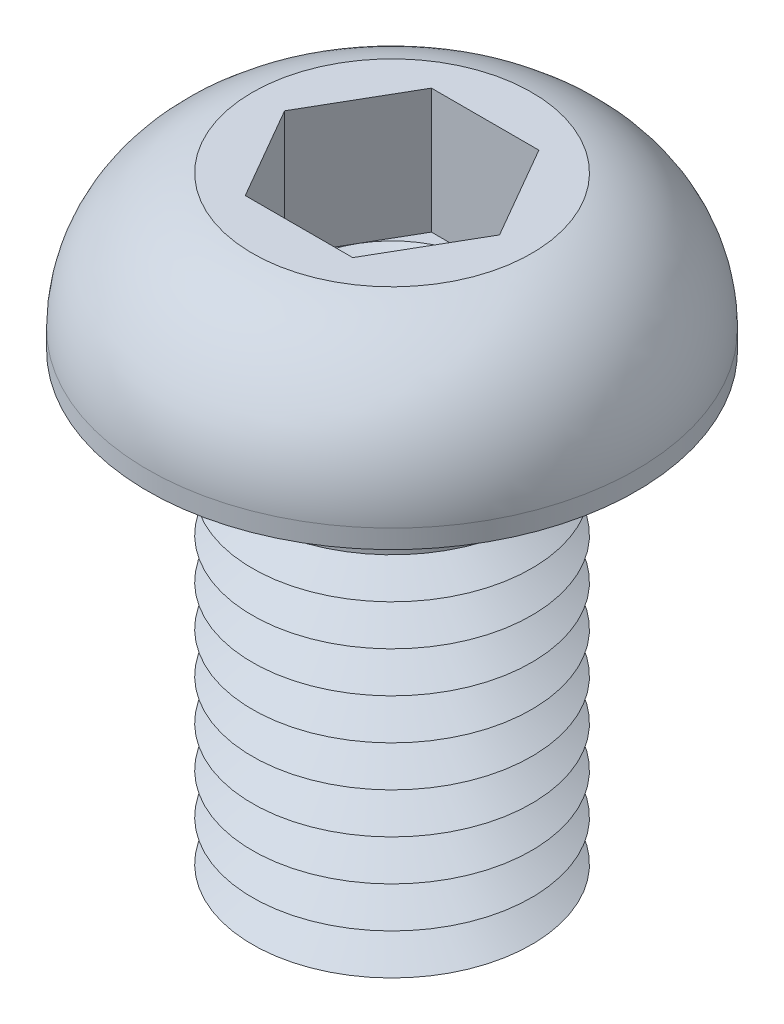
ISO-10303-21;
HEADER;
FILE_DESCRIPTION(('STEP AP214'),'2;1');
FILE_NAME('part.step','',(''),(''),'','','');
FILE_SCHEMA(('AUTOMOTIVE_DESIGN { 1 0 10303 214 1 1 1 1 }'));
ENDSEC;
DATA;
#1=APPLICATION_CONTEXT('core data for automotive mechanical design processes');
#2=APPLICATION_PROTOCOL_DEFINITION('international standard','automotive_design',2000,#1);
#3=PRODUCT_CONTEXT('',#1,'mechanical');
#4=PRODUCT('Part','Part','',(#3));
#5=PRODUCT_RELATED_PRODUCT_CATEGORY('part','',(#4));
#6=PRODUCT_DEFINITION_FORMATION('','',#4);
#7=PRODUCT_DEFINITION_CONTEXT('part definition',#1,'design');
#8=PRODUCT_DEFINITION('design','',#6,#7);
#9=PRODUCT_DEFINITION_SHAPE('','',#8);
#10=(LENGTH_UNIT() NAMED_UNIT(*) SI_UNIT(.MILLI.,.METRE.));
#11=(NAMED_UNIT(*) PLANE_ANGLE_UNIT() SI_UNIT($,.RADIAN.));
#12=(NAMED_UNIT(*) SI_UNIT($,.STERADIAN.) SOLID_ANGLE_UNIT());
#13=UNCERTAINTY_MEASURE_WITH_UNIT(LENGTH_MEASURE(1.E-05),#10,'distance_accuracy_value','');
#14=(GEOMETRIC_REPRESENTATION_CONTEXT(3) GLOBAL_UNCERTAINTY_ASSIGNED_CONTEXT((#13)) GLOBAL_UNIT_ASSIGNED_CONTEXT((#10,
#11,#12)) REPRESENTATION_CONTEXT('',''));
#15=CARTESIAN_POINT('',(0.,0.,0.));
#16=DIRECTION('',(0.,0.,1.));
#17=DIRECTION('',(1.,0.,0.));
#18=AXIS2_PLACEMENT_3D('',#15,#16,#17);
#19=CARTESIAN_POINT('',(0.,0.,0.));
#20=DIRECTION('',(0.,-1.,0.));
#21=DIRECTION('',(0.,0.,-1.));
#22=AXIS2_PLACEMENT_3D('',#19,#20,#21);
#23=TOROIDAL_SURFACE('',#22,6.875,0.875);
#24=CARTESIAN_POINT('',(0.,0.,-7.75));
#25=VERTEX_POINT('',#24);
#26=VERTEX_LOOP('',#25);
#27=FACE_BOUND('',#26,.T.);
#28=ADVANCED_FACE('P0_F12',(#27),#23,.T.);
#29=CLOSED_SHELL('',(#28));
#30=MANIFOLD_SOLID_BREP('P0_B1',#29);
#31=CARTESIAN_POINT('',(2.3094010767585,1.24,-4.));
#32=DIRECTION('',(0.,1.,0.));
#33=DIRECTION('',(0.,0.,1.));
#34=AXIS2_PLACEMENT_3D('',#31,#32,#33);
#35=PLANE('',#34);
#36=CARTESIAN_POINT('',(0.,1.24,0.));
#37=DIRECTION('',(0.,1.,0.));
#38=DIRECTION('',(0.,0.,1.));
#39=AXIS2_PLACEMENT_3D('',#36,#37,#38);
#40=CIRCLE('',#39,4.);
#41=CARTESIAN_POINT('',(0.,1.24,4.));
#42=VERTEX_POINT('',#41);
#43=CARTESIAN_POINT('',(3.46410161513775,1.24,2.));
#44=VERTEX_POINT('',#43);
#45=EDGE_CURVE('P1_E93',#42,#44,#40,.T.);
#46=ORIENTED_EDGE('',*,*,#45,.F.);
#47=DIRECTION('',(1.,0.,0.));
#48=VECTOR('',#47,1.);
#49=CARTESIAN_POINT('',(-2.3094010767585,1.24,4.));
#50=LINE('',#49,#48);
#51=CARTESIAN_POINT('',(2.3094010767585,1.24,4.));
#52=VERTEX_POINT('',#51);
#53=EDGE_CURVE('P1_E116',#42,#52,#50,.T.);
#54=ORIENTED_EDGE('',*,*,#53,.T.);
#55=DIRECTION('',(0.5,0.,-0.866025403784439));
#56=VECTOR('',#55,1.);
#57=CARTESIAN_POINT('',(2.3094010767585,1.24,4.));
#58=LINE('',#57,#56);
#59=EDGE_CURVE('P1_E112',#52,#44,#58,.T.);
#60=ORIENTED_EDGE('',*,*,#59,.T.);
#61=EDGE_LOOP('',(#46,#54,#60));
#62=FACE_BOUND('',#61,.T.);
#63=ADVANCED_FACE('P1_F15',(#62),#35,.T.);
#64=CARTESIAN_POINT('',(0.,1.24,0.));
#65=DIRECTION('',(0.,1.,0.));
#66=DIRECTION('',(0.,0.,1.));
#67=AXIS2_PLACEMENT_3D('',#64,#65,#66);
#68=CIRCLE('',#67,4.);
#69=CARTESIAN_POINT('',(3.46410161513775,1.24,-2.));
#70=VERTEX_POINT('',#69);
#71=EDGE_CURVE('P1_E10',#44,#70,#68,.T.);
#72=ORIENTED_EDGE('',*,*,#71,.F.);
#73=CARTESIAN_POINT('',(4.61880215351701,1.24,0.));
#74=VERTEX_POINT('',#73);
#75=EDGE_CURVE('P1_E104',#44,#74,#58,.T.);
#76=ORIENTED_EDGE('',*,*,#75,.T.);
#77=DIRECTION('',(-0.5,0.,-0.866025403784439));
#78=VECTOR('',#77,1.);
#79=CARTESIAN_POINT('',(4.61880215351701,1.24,0.));
#80=LINE('',#79,#78);
#81=EDGE_CURVE('P1_E107',#74,#70,#80,.T.);
#82=ORIENTED_EDGE('',*,*,#81,.T.);
#83=EDGE_LOOP('',(#72,#76,#82));
#84=FACE_BOUND('',#83,.T.);
#85=ADVANCED_FACE('P1_F103',(#84),#35,.T.);
#86=CARTESIAN_POINT('',(0.,1.24,-4.));
#87=VERTEX_POINT('',#86);
#88=EDGE_CURVE('P1_E24',#70,#87,#68,.T.);
#89=ORIENTED_EDGE('',*,*,#88,.F.);
#90=CARTESIAN_POINT('',(2.3094010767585,1.24,-4.));
#91=VERTEX_POINT('',#90);
#92=EDGE_CURVE('P1_E139',#70,#91,#80,.T.);
#93=ORIENTED_EDGE('',*,*,#92,.T.);
#94=DIRECTION('',(-1.,0.,0.));
#95=VECTOR('',#94,1.);
#96=CARTESIAN_POINT('',(2.3094010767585,1.24,-4.));
#97=LINE('',#96,#95);
#98=EDGE_CURVE('P1_E282',#91,#87,#97,.T.);
#99=ORIENTED_EDGE('',*,*,#98,.T.);
#100=EDGE_LOOP('',(#89,#93,#99));
#101=FACE_BOUND('',#100,.T.);
#102=ADVANCED_FACE('P1_F247',(#101),#35,.T.);
#103=CARTESIAN_POINT('',(-3.46410161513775,1.24,-2.));
#104=VERTEX_POINT('',#103);
#105=EDGE_CURVE('P1_E277',#87,#104,#68,.T.);
#106=ORIENTED_EDGE('',*,*,#105,.F.);
#107=CARTESIAN_POINT('',(-2.3094010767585,1.24,-4.));
#108=VERTEX_POINT('',#107);
#109=EDGE_CURVE('P1_E286',#87,#108,#97,.T.);
#110=ORIENTED_EDGE('',*,*,#109,.T.);
#111=DIRECTION('',(-0.5,0.,0.866025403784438));
#112=VECTOR('',#111,1.);
#113=CARTESIAN_POINT('',(-2.3094010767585,1.24,-4.));
#114=LINE('',#113,#112);
#115=EDGE_CURVE('P1_E281',#108,#104,#114,.T.);
#116=ORIENTED_EDGE('',*,*,#115,.T.);
#117=EDGE_LOOP('',(#106,#110,#116));
#118=FACE_BOUND('',#117,.T.);
#119=ADVANCED_FACE('P1_F261',(#118),#35,.T.);
#120=CARTESIAN_POINT('',(-3.46410161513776,1.24,2.));
#121=VERTEX_POINT('',#120);
#122=EDGE_CURVE('P1_E31',#104,#121,#68,.T.);
#123=ORIENTED_EDGE('',*,*,#122,.F.);
#124=CARTESIAN_POINT('',(-4.61880215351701,1.24,0.));
#125=VERTEX_POINT('',#124);
#126=EDGE_CURVE('P1_E273',#104,#125,#114,.T.);
#127=ORIENTED_EDGE('',*,*,#126,.T.);
#128=DIRECTION('',(0.5,0.,0.866025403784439));
#129=VECTOR('',#128,1.);
#130=CARTESIAN_POINT('',(-4.61880215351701,1.24,0.));
#131=LINE('',#130,#129);
#132=EDGE_CURVE('P1_E276',#125,#121,#131,.T.);
#133=ORIENTED_EDGE('',*,*,#132,.T.);
#134=EDGE_LOOP('',(#123,#127,#133));
#135=FACE_BOUND('',#134,.T.);
#136=ADVANCED_FACE('P1_F252',(#135),#35,.T.);
#137=CARTESIAN_POINT('',(0.,-18.25,0.));
#138=DIRECTION('',(0.,1.,0.));
#139=DIRECTION('',(0.,0.,1.));
#140=AXIS2_PLACEMENT_3D('',#137,#138,#139);
#141=CONICAL_SURFACE('',#140,4.48445554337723,1.0471975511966);
#142=CARTESIAN_POINT('',(0.,-17.375,0.));
#143=DIRECTION('',(0.,-1.,0.));
#144=DIRECTION('',(0.,0.,-1.));
#145=AXIS2_PLACEMENT_3D('',#142,#143,#144);
#146=CIRCLE('',#145,6.);
#147=CARTESIAN_POINT('',(0.,-17.375,-6.));
#148=VERTEX_POINT('',#147);
#149=EDGE_CURVE('P1_E209',#148,#148,#146,.T.);
#150=ORIENTED_EDGE('',*,*,#149,.T.);
#151=EDGE_LOOP('',(#150));
#152=FACE_BOUND('',#151,.T.);
#153=CARTESIAN_POINT('',(0.,-18.25,0.));
#154=DIRECTION('',(0.,-1.,0.));
#155=DIRECTION('',(0.,0.,-1.));
#156=AXIS2_PLACEMENT_3D('',#153,#154,#155);
#157=CIRCLE('',#156,4.48445554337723);
#158=CARTESIAN_POINT('',(0.,-18.25,-4.48445554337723));
#159=VERTEX_POINT('',#158);
#160=EDGE_CURVE('P1_E212',#159,#159,#157,.T.);
#161=ORIENTED_EDGE('',*,*,#160,.F.);
#162=EDGE_LOOP('',(#161));
#163=FACE_BOUND('',#162,.T.);
#164=ADVANCED_FACE('P1_F260',(#152,#163),#141,.T.);
#165=CARTESIAN_POINT('',(0.,-19.125,0.));
#166=DIRECTION('',(0.,-1.,0.));
#167=DIRECTION('',(0.,0.,-1.));
#168=AXIS2_PLACEMENT_3D('',#165,#166,#167);
#169=CONICAL_SURFACE('',#168,6.,1.0471975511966);
#170=ORIENTED_EDGE('',*,*,#160,.T.);
#171=EDGE_LOOP('',(#170));
#172=FACE_BOUND('',#171,.T.);
#173=CARTESIAN_POINT('',(0.,-19.125,0.));
#174=DIRECTION('',(0.,-1.,0.));
#175=DIRECTION('',(0.,0.,-1.));
#176=AXIS2_PLACEMENT_3D('',#173,#174,#175);
#177=CIRCLE('',#176,6.);
#178=CARTESIAN_POINT('',(0.,-19.125,-6.));
#179=VERTEX_POINT('',#178);
#180=EDGE_CURVE('P1_E215',#179,#179,#177,.T.);
#181=ORIENTED_EDGE('',*,*,#180,.F.);
#182=EDGE_LOOP('',(#181));
#183=FACE_BOUND('',#182,.T.);
#184=ADVANCED_FACE('P1_F267',(#172,#183),#169,.T.);
#185=CARTESIAN_POINT('',(0.,-20.,0.));
#186=DIRECTION('',(0.,1.,0.));
#187=DIRECTION('',(0.,0.,1.));
#188=AXIS2_PLACEMENT_3D('',#185,#186,#187);
#189=PLANE('',#188);
#190=CARTESIAN_POINT('',(0.,-20.,0.));
#191=DIRECTION('',(0.,-1.,0.));
#192=DIRECTION('',(0.,0.,-1.));
#193=AXIS2_PLACEMENT_3D('',#190,#191,#192);
#194=CIRCLE('',#193,4.48445554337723);
#195=CARTESIAN_POINT('',(0.,-20.,-4.48445554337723));
#196=VERTEX_POINT('',#195);
#197=EDGE_CURVE('P1_E218',#196,#196,#194,.T.);
#198=ORIENTED_EDGE('',*,*,#197,.T.);
#199=EDGE_LOOP('',(#198));
#200=FACE_BOUND('',#199,.T.);
#201=ADVANCED_FACE('P1_F345',(#200),#189,.F.);
#202=CARTESIAN_POINT('',(0.,-20.,0.));
#203=DIRECTION('',(0.,1.,0.));
#204=DIRECTION('',(0.,0.,1.));
#205=AXIS2_PLACEMENT_3D('',#202,#203,#204);
#206=CONICAL_SURFACE('',#205,4.48445554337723,1.0471975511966);
#207=ORIENTED_EDGE('',*,*,#180,.T.);
#208=EDGE_LOOP('',(#207));
#209=FACE_BOUND('',#208,.T.);
#210=ORIENTED_EDGE('',*,*,#197,.F.);
#211=EDGE_LOOP('',(#210));
#212=FACE_BOUND('',#211,.T.);
#213=ADVANCED_FACE('P1_F356',(#209,#212),#206,.T.);
#214=CARTESIAN_POINT('',(0.,-16.5,0.));
#215=DIRECTION('',(0.,1.,0.));
#216=DIRECTION('',(0.,0.,1.));
#217=AXIS2_PLACEMENT_3D('',#214,#215,#216);
#218=CONICAL_SURFACE('',#217,4.48445554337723,1.0471975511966);
#219=CARTESIAN_POINT('',(0.,-15.625,0.));
#220=DIRECTION('',(0.,-1.,0.));
#221=DIRECTION('',(0.,0.,-1.));
#222=AXIS2_PLACEMENT_3D('',#219,#220,#221);
#223=CIRCLE('',#222,6.);
#224=CARTESIAN_POINT('',(0.,-15.625,-6.));
#225=VERTEX_POINT('',#224);
#226=EDGE_CURVE('P1_E203',#225,#225,#223,.T.);
#227=ORIENTED_EDGE('',*,*,#226,.T.);
#228=EDGE_LOOP('',(#227));
#229=FACE_BOUND('',#228,.T.);
#230=CARTESIAN_POINT('',(0.,-16.5,0.));
#231=DIRECTION('',(0.,-1.,0.));
#232=DIRECTION('',(0.,0.,-1.));
#233=AXIS2_PLACEMENT_3D('',#230,#231,#232);
#234=CIRCLE('',#233,4.48445554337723);
#235=CARTESIAN_POINT('',(0.,-16.5,-4.48445554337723));
#236=VERTEX_POINT('',#235);
#237=EDGE_CURVE('P1_E206',#236,#236,#234,.T.);
#238=ORIENTED_EDGE('',*,*,#237,.F.);
#239=EDGE_LOOP('',(#238));
#240=FACE_BOUND('',#239,.T.);
#241=ADVANCED_FACE('P1_F365',(#229,#240),#218,.T.);
#242=CARTESIAN_POINT('',(0.,-17.375,0.));
#243=DIRECTION('',(0.,-1.,0.));
#244=DIRECTION('',(0.,0.,-1.));
#245=AXIS2_PLACEMENT_3D('',#242,#243,#244);
#246=CONICAL_SURFACE('',#245,6.,1.0471975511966);
#247=ORIENTED_EDGE('',*,*,#237,.T.);
#248=EDGE_LOOP('',(#247));
#249=FACE_BOUND('',#248,.T.);
#250=ORIENTED_EDGE('',*,*,#149,.F.);
#251=EDGE_LOOP('',(#250));
#252=FACE_BOUND('',#251,.T.);
#253=ADVANCED_FACE('P1_F374',(#249,#252),#246,.T.);
#254=CARTESIAN_POINT('',(0.,-14.75,0.));
#255=DIRECTION('',(0.,1.,0.));
#256=DIRECTION('',(0.,0.,1.));
#257=AXIS2_PLACEMENT_3D('',#254,#255,#256);
#258=CONICAL_SURFACE('',#257,4.48445554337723,1.0471975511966);
#259=CARTESIAN_POINT('',(0.,-13.875,0.));
#260=DIRECTION('',(0.,-1.,0.));
#261=DIRECTION('',(0.,0.,-1.));
#262=AXIS2_PLACEMENT_3D('',#259,#260,#261);
#263=CIRCLE('',#262,6.);
#264=CARTESIAN_POINT('',(0.,-13.875,-6.));
#265=VERTEX_POINT('',#264);
#266=EDGE_CURVE('P1_E197',#265,#265,#263,.T.);
#267=ORIENTED_EDGE('',*,*,#266,.T.);
#268=EDGE_LOOP('',(#267));
#269=FACE_BOUND('',#268,.T.);
#270=CARTESIAN_POINT('',(0.,-14.75,0.));
#271=DIRECTION('',(0.,-1.,0.));
#272=DIRECTION('',(0.,0.,-1.));
#273=AXIS2_PLACEMENT_3D('',#270,#271,#272);
#274=CIRCLE('',#273,4.48445554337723);
#275=CARTESIAN_POINT('',(0.,-14.75,-4.48445554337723));
#276=VERTEX_POINT('',#275);
#277=EDGE_CURVE('P1_E200',#276,#276,#274,.T.);
#278=ORIENTED_EDGE('',*,*,#277,.F.);
#279=EDGE_LOOP('',(#278));
#280=FACE_BOUND('',#279,.T.);
#281=ADVANCED_FACE('P1_F384',(#269,#280),#258,.T.);
#282=CARTESIAN_POINT('',(0.,-15.625,0.));
#283=DIRECTION('',(0.,-1.,0.));
#284=DIRECTION('',(0.,0.,-1.));
#285=AXIS2_PLACEMENT_3D('',#282,#283,#284);
#286=CONICAL_SURFACE('',#285,6.,1.0471975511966);
#287=ORIENTED_EDGE('',*,*,#277,.T.);
#288=EDGE_LOOP('',(#287));
#289=FACE_BOUND('',#288,.T.);
#290=ORIENTED_EDGE('',*,*,#226,.F.);
#291=EDGE_LOOP('',(#290));
#292=FACE_BOUND('',#291,.T.);
#293=ADVANCED_FACE('P1_F394',(#289,#292),#286,.T.);
#294=CARTESIAN_POINT('',(0.,-13.,0.));
#295=DIRECTION('',(0.,1.,0.));
#296=DIRECTION('',(0.,0.,1.));
#297=AXIS2_PLACEMENT_3D('',#294,#295,#296);
#298=CONICAL_SURFACE('',#297,4.48445554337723,1.0471975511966);
#299=CARTESIAN_POINT('',(0.,-12.125,0.));
#300=DIRECTION('',(0.,-1.,0.));
#301=DIRECTION('',(0.,0.,-1.));
#302=AXIS2_PLACEMENT_3D('',#299,#300,#301);
#303=CIRCLE('',#302,6.);
#304=CARTESIAN_POINT('',(0.,-12.125,-6.));
#305=VERTEX_POINT('',#304);
#306=EDGE_CURVE('P1_E191',#305,#305,#303,.T.);
#307=ORIENTED_EDGE('',*,*,#306,.T.);
#308=EDGE_LOOP('',(#307));
#309=FACE_BOUND('',#308,.T.);
#310=CARTESIAN_POINT('',(0.,-13.,0.));
#311=DIRECTION('',(0.,-1.,0.));
#312=DIRECTION('',(0.,0.,-1.));
#313=AXIS2_PLACEMENT_3D('',#310,#311,#312);
#314=CIRCLE('',#313,4.48445554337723);
#315=CARTESIAN_POINT('',(0.,-13.,-4.48445554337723));
#316=VERTEX_POINT('',#315);
#317=EDGE_CURVE('P1_E194',#316,#316,#314,.T.);
#318=ORIENTED_EDGE('',*,*,#317,.F.);
#319=EDGE_LOOP('',(#318));
#320=FACE_BOUND('',#319,.T.);
#321=ADVANCED_FACE('P1_F404',(#309,#320),#298,.T.);
#322=CARTESIAN_POINT('',(0.,-13.875,0.));
#323=DIRECTION('',(0.,-1.,0.));
#324=DIRECTION('',(0.,0.,-1.));
#325=AXIS2_PLACEMENT_3D('',#322,#323,#324);
#326=CONICAL_SURFACE('',#325,6.,1.0471975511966);
#327=ORIENTED_EDGE('',*,*,#317,.T.);
#328=EDGE_LOOP('',(#327));
#329=FACE_BOUND('',#328,.T.);
#330=ORIENTED_EDGE('',*,*,#266,.F.);
#331=EDGE_LOOP('',(#330));
#332=FACE_BOUND('',#331,.T.);
#333=ADVANCED_FACE('P1_F414',(#329,#332),#326,.T.);
#334=CARTESIAN_POINT('',(0.,-11.25,0.));
#335=DIRECTION('',(0.,1.,0.));
#336=DIRECTION('',(0.,0.,1.));
#337=AXIS2_PLACEMENT_3D('',#334,#335,#336);
#338=CONICAL_SURFACE('',#337,4.48445554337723,1.0471975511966);
#339=CARTESIAN_POINT('',(0.,-10.375,0.));
#340=DIRECTION('',(0.,-1.,0.));
#341=DIRECTION('',(0.,0.,-1.));
#342=AXIS2_PLACEMENT_3D('',#339,#340,#341);
#343=CIRCLE('',#342,6.);
#344=CARTESIAN_POINT('',(0.,-10.375,-6.));
#345=VERTEX_POINT('',#344);
#346=EDGE_CURVE('P1_E185',#345,#345,#343,.T.);
#347=ORIENTED_EDGE('',*,*,#346,.T.);
#348=EDGE_LOOP('',(#347));
#349=FACE_BOUND('',#348,.T.);
#350=CARTESIAN_POINT('',(0.,-11.25,0.));
#351=DIRECTION('',(0.,-1.,0.));
#352=DIRECTION('',(0.,0.,-1.));
#353=AXIS2_PLACEMENT_3D('',#350,#351,#352);
#354=CIRCLE('',#353,4.48445554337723);
#355=CARTESIAN_POINT('',(0.,-11.25,-4.48445554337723));
#356=VERTEX_POINT('',#355);
#357=EDGE_CURVE('P1_E188',#356,#356,#354,.T.);
#358=ORIENTED_EDGE('',*,*,#357,.F.);
#359=EDGE_LOOP('',(#358));
#360=FACE_BOUND('',#359,.T.);
#361=ADVANCED_FACE('P1_F424',(#349,#360),#338,.T.);
#362=CARTESIAN_POINT('',(0.,-12.125,0.));
#363=DIRECTION('',(0.,-1.,0.));
#364=DIRECTION('',(0.,0.,-1.));
#365=AXIS2_PLACEMENT_3D('',#362,#363,#364);
#366=CONICAL_SURFACE('',#365,6.,1.0471975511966);
#367=ORIENTED_EDGE('',*,*,#357,.T.);
#368=EDGE_LOOP('',(#367));
#369=FACE_BOUND('',#368,.T.);
#370=ORIENTED_EDGE('',*,*,#306,.F.);
#371=EDGE_LOOP('',(#370));
#372=FACE_BOUND('',#371,.T.);
#373=ADVANCED_FACE('P1_F434',(#369,#372),#366,.T.);
#374=CARTESIAN_POINT('',(0.,-9.5,0.));
#375=DIRECTION('',(0.,1.,0.));
#376=DIRECTION('',(0.,0.,1.));
#377=AXIS2_PLACEMENT_3D('',#374,#375,#376);
#378=CONICAL_SURFACE('',#377,4.48445554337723,1.0471975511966);
#379=CARTESIAN_POINT('',(0.,-8.625,0.));
#380=DIRECTION('',(0.,-1.,0.));
#381=DIRECTION('',(0.,0.,-1.));
#382=AXIS2_PLACEMENT_3D('',#379,#380,#381);
#383=CIRCLE('',#382,6.);
#384=CARTESIAN_POINT('',(0.,-8.625,-6.));
#385=VERTEX_POINT('',#384);
#386=EDGE_CURVE('P1_E179',#385,#385,#383,.T.);
#387=ORIENTED_EDGE('',*,*,#386,.T.);
#388=EDGE_LOOP('',(#387));
#389=FACE_BOUND('',#388,.T.);
#390=CARTESIAN_POINT('',(0.,-9.5,0.));
#391=DIRECTION('',(0.,-1.,0.));
#392=DIRECTION('',(0.,0.,-1.));
#393=AXIS2_PLACEMENT_3D('',#390,#391,#392);
#394=CIRCLE('',#393,4.48445554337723);
#395=CARTESIAN_POINT('',(0.,-9.5,-4.48445554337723));
#396=VERTEX_POINT('',#395);
#397=EDGE_CURVE('P1_E182',#396,#396,#394,.T.);
#398=ORIENTED_EDGE('',*,*,#397,.F.);
#399=EDGE_LOOP('',(#398));
#400=FACE_BOUND('',#399,.T.);
#401=ADVANCED_FACE('P1_F444',(#389,#400),#378,.T.);
#402=CARTESIAN_POINT('',(0.,-10.375,0.));
#403=DIRECTION('',(0.,-1.,0.));
#404=DIRECTION('',(0.,0.,-1.));
#405=AXIS2_PLACEMENT_3D('',#402,#403,#404);
#406=CONICAL_SURFACE('',#405,6.,1.0471975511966);
#407=ORIENTED_EDGE('',*,*,#397,.T.);
#408=EDGE_LOOP('',(#407));
#409=FACE_BOUND('',#408,.T.);
#410=ORIENTED_EDGE('',*,*,#346,.F.);
#411=EDGE_LOOP('',(#410));
#412=FACE_BOUND('',#411,.T.);
#413=ADVANCED_FACE('P1_F454',(#409,#412),#406,.T.);
#414=CARTESIAN_POINT('',(0.,-7.75,0.));
#415=DIRECTION('',(0.,1.,0.));
#416=DIRECTION('',(0.,0.,1.));
#417=AXIS2_PLACEMENT_3D('',#414,#415,#416);
#418=CONICAL_SURFACE('',#417,4.48445554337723,1.0471975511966);
#419=CARTESIAN_POINT('',(0.,-6.875,0.));
#420=DIRECTION('',(0.,-1.,0.));
#421=DIRECTION('',(0.,0.,-1.));
#422=AXIS2_PLACEMENT_3D('',#419,#420,#421);
#423=CIRCLE('',#422,6.);
#424=CARTESIAN_POINT('',(0.,-6.875,-6.));
#425=VERTEX_POINT('',#424);
#426=EDGE_CURVE('P1_E173',#425,#425,#423,.T.);
#427=ORIENTED_EDGE('',*,*,#426,.T.);
#428=EDGE_LOOP('',(#427));
#429=FACE_BOUND('',#428,.T.);
#430=CARTESIAN_POINT('',(0.,-7.75,0.));
#431=DIRECTION('',(0.,-1.,0.));
#432=DIRECTION('',(0.,0.,-1.));
#433=AXIS2_PLACEMENT_3D('',#430,#431,#432);
#434=CIRCLE('',#433,4.48445554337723);
#435=CARTESIAN_POINT('',(0.,-7.75,-4.48445554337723));
#436=VERTEX_POINT('',#435);
#437=EDGE_CURVE('P1_E176',#436,#436,#434,.T.);
#438=ORIENTED_EDGE('',*,*,#437,.F.);
#439=EDGE_LOOP('',(#438));
#440=FACE_BOUND('',#439,.T.);
#441=ADVANCED_FACE('P1_F464',(#429,#440),#418,.T.);
#442=CARTESIAN_POINT('',(0.,-8.625,0.));
#443=DIRECTION('',(0.,-1.,0.));
#444=DIRECTION('',(0.,0.,-1.));
#445=AXIS2_PLACEMENT_3D('',#442,#443,#444);
#446=CONICAL_SURFACE('',#445,6.,1.0471975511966);
#447=ORIENTED_EDGE('',*,*,#437,.T.);
#448=EDGE_LOOP('',(#447));
#449=FACE_BOUND('',#448,.T.);
#450=ORIENTED_EDGE('',*,*,#386,.F.);
#451=EDGE_LOOP('',(#450));
#452=FACE_BOUND('',#451,.T.);
#453=ADVANCED_FACE('P1_F474',(#449,#452),#446,.T.);
#454=CARTESIAN_POINT('',(0.,-6.,0.));
#455=DIRECTION('',(0.,1.,0.));
#456=DIRECTION('',(0.,0.,1.));
#457=AXIS2_PLACEMENT_3D('',#454,#455,#456);
#458=CONICAL_SURFACE('',#457,4.48445554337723,1.0471975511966);
#459=CARTESIAN_POINT('',(0.,-5.125,0.));
#460=DIRECTION('',(0.,-1.,0.));
#461=DIRECTION('',(0.,0.,-1.));
#462=AXIS2_PLACEMENT_3D('',#459,#460,#461);
#463=CIRCLE('',#462,6.);
#464=CARTESIAN_POINT('',(0.,-5.125,-6.));
#465=VERTEX_POINT('',#464);
#466=EDGE_CURVE('P1_E164',#465,#465,#463,.T.);
#467=ORIENTED_EDGE('',*,*,#466,.T.);
#468=EDGE_LOOP('',(#467));
#469=FACE_BOUND('',#468,.T.);
#470=CARTESIAN_POINT('',(0.,-6.,0.));
#471=DIRECTION('',(0.,-1.,0.));
#472=DIRECTION('',(0.,0.,-1.));
#473=AXIS2_PLACEMENT_3D('',#470,#471,#472);
#474=CIRCLE('',#473,4.48445554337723);
#475=CARTESIAN_POINT('',(0.,-6.,-4.48445554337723));
#476=VERTEX_POINT('',#475);
#477=EDGE_CURVE('P1_E170',#476,#476,#474,.T.);
#478=ORIENTED_EDGE('',*,*,#477,.F.);
#479=EDGE_LOOP('',(#478));
#480=FACE_BOUND('',#479,.T.);
#481=ADVANCED_FACE('P1_F484',(#469,#480),#458,.T.);
#482=CARTESIAN_POINT('',(0.,-6.875,0.));
#483=DIRECTION('',(0.,-1.,0.));
#484=DIRECTION('',(0.,0.,-1.));
#485=AXIS2_PLACEMENT_3D('',#482,#483,#484);
#486=CONICAL_SURFACE('',#485,6.,1.0471975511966);
#487=ORIENTED_EDGE('',*,*,#477,.T.);
#488=EDGE_LOOP('',(#487));
#489=FACE_BOUND('',#488,.T.);
#490=ORIENTED_EDGE('',*,*,#426,.F.);
#491=EDGE_LOOP('',(#490));
#492=FACE_BOUND('',#491,.T.);
#493=ADVANCED_FACE('P1_F494',(#489,#492),#486,.T.);
#494=CARTESIAN_POINT('',(0.,-4.25,0.));
#495=DIRECTION('',(0.,1.,0.));
#496=DIRECTION('',(0.,0.,1.));
#497=AXIS2_PLACEMENT_3D('',#494,#495,#496);
#498=CONICAL_SURFACE('',#497,4.48445554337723,1.0471975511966);
#499=CARTESIAN_POINT('',(0.,-3.375,0.));
#500=DIRECTION('',(0.,-1.,0.));
#501=DIRECTION('',(0.,0.,-1.));
#502=AXIS2_PLACEMENT_3D('',#499,#500,#501);
#503=CIRCLE('',#502,6.);
#504=CARTESIAN_POINT('',(0.,-3.375,-6.));
#505=VERTEX_POINT('',#504);
#506=EDGE_CURVE('P1_E167',#505,#505,#503,.T.);
#507=ORIENTED_EDGE('',*,*,#506,.T.);
#508=EDGE_LOOP('',(#507));
#509=FACE_BOUND('',#508,.T.);
#510=CARTESIAN_POINT('',(0.,-4.25,0.));
#511=DIRECTION('',(0.,-1.,0.));
#512=DIRECTION('',(0.,0.,-1.));
#513=AXIS2_PLACEMENT_3D('',#510,#511,#512);
#514=CIRCLE('',#513,4.48445554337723);
#515=CARTESIAN_POINT('',(0.,-4.25,-4.48445554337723));
#516=VERTEX_POINT('',#515);
#517=EDGE_CURVE('P1_E161',#516,#516,#514,.T.);
#518=ORIENTED_EDGE('',*,*,#517,.F.);
#519=EDGE_LOOP('',(#518));
#520=FACE_BOUND('',#519,.T.);
#521=ADVANCED_FACE('P1_F504',(#509,#520),#498,.T.);
#522=CARTESIAN_POINT('',(0.,-5.125,0.));
#523=DIRECTION('',(0.,-1.,0.));
#524=DIRECTION('',(0.,0.,-1.));
#525=AXIS2_PLACEMENT_3D('',#522,#523,#524);
#526=CONICAL_SURFACE('',#525,6.,1.0471975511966);
#527=ORIENTED_EDGE('',*,*,#517,.T.);
#528=EDGE_LOOP('',(#527));
#529=FACE_BOUND('',#528,.T.);
#530=ORIENTED_EDGE('',*,*,#466,.F.);
#531=EDGE_LOOP('',(#530));
#532=FACE_BOUND('',#531,.T.);
#533=ADVANCED_FACE('P1_F514',(#529,#532),#526,.T.);
#534=CARTESIAN_POINT('',(0.,-20.,0.));
#535=DIRECTION('',(0.,1.,0.));
#536=DIRECTION('',(0.,0.,1.));
#537=AXIS2_PLACEMENT_3D('',#534,#535,#536);
#538=CYLINDRICAL_SURFACE('',#537,6.);
#539=CARTESIAN_POINT('',(0.,0.,0.));
#540=DIRECTION('',(0.,-1.,0.));
#541=DIRECTION('',(1.,0.,0.));
#542=AXIS2_PLACEMENT_3D('',#539,#540,#541);
#543=CIRCLE('',#542,6.);
#544=CARTESIAN_POINT('',(6.,0.,0.));
#545=VERTEX_POINT('',#544);
#546=EDGE_CURVE('P1_E141',#545,#545,#543,.F.);
#547=ORIENTED_EDGE('',*,*,#546,.F.);
#548=EDGE_LOOP('',(#547));
#549=FACE_BOUND('',#548,.T.);
#550=ORIENTED_EDGE('',*,*,#506,.F.);
#551=EDGE_LOOP('',(#550));
#552=FACE_BOUND('',#551,.T.);
#553=ADVANCED_FACE('P1_F17',(#549,#552),#538,.T.);
#554=CARTESIAN_POINT('',(0.,0.,0.));
#555=DIRECTION('',(0.,-1.,0.));
#556=DIRECTION('',(0.,0.,-1.));
#557=AXIS2_PLACEMENT_3D('',#554,#555,#556);
#558=TOROIDAL_SURFACE('',#557,6.875,0.875);
#559=ORIENTED_EDGE('',*,*,#546,.T.);
#560=EDGE_LOOP('',(#559));
#561=FACE_BOUND('',#560,.T.);
#562=CARTESIAN_POINT('',(0.,0.,0.));
#563=DIRECTION('',(0.,1.,0.));
#564=DIRECTION('',(-1.,0.,0.));
#565=AXIS2_PLACEMENT_3D('',#562,#563,#564);
#566=CIRCLE('',#565,7.75);
#567=CARTESIAN_POINT('',(-7.75,0.,0.));
#568=VERTEX_POINT('',#567);
#569=EDGE_CURVE('P1_E151',#568,#568,#566,.F.);
#570=ORIENTED_EDGE('',*,*,#569,.T.);
#571=EDGE_LOOP('',(#570));
#572=FACE_BOUND('',#571,.T.);
#573=ADVANCED_FACE('P1_F223',(#561,#572),#558,.F.);
#574=CARTESIAN_POINT('',(6.,6.6,0.));
#575=DIRECTION('',(0.,-1.,0.));
#576=DIRECTION('',(1.,0.,0.));
#577=AXIS2_PLACEMENT_3D('',#574,#575,#576);
#578=PLANE('',#577);
#579=DIRECTION('',(-1.,0.,0.));
#580=VECTOR('',#579,1.);
#581=CARTESIAN_POINT('',(2.3094010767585,6.6,-4.));
#582=LINE('',#581,#580);
#583=CARTESIAN_POINT('',(2.3094010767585,6.6,-4.));
#584=VERTEX_POINT('',#583);
#585=CARTESIAN_POINT('',(-2.3094010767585,6.6,-4.));
#586=VERTEX_POINT('',#585);
#587=EDGE_CURVE('P1_E125',#584,#586,#582,.T.);
#588=ORIENTED_EDGE('',*,*,#587,.F.);
#589=DIRECTION('',(-0.5,0.,-0.866025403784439));
#590=VECTOR('',#589,1.);
#591=CARTESIAN_POINT('',(4.61880215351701,6.6,0.));
#592=LINE('',#591,#590);
#593=CARTESIAN_POINT('',(4.61880215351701,6.6,0.));
#594=VERTEX_POINT('',#593);
#595=EDGE_CURVE('P1_E39',#594,#584,#592,.T.);
#596=ORIENTED_EDGE('',*,*,#595,.F.);
#597=DIRECTION('',(0.5,0.,-0.866025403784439));
#598=VECTOR('',#597,1.);
#599=CARTESIAN_POINT('',(2.3094010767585,6.6,4.));
#600=LINE('',#599,#598);
#601=CARTESIAN_POINT('',(2.3094010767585,6.6,4.));
#602=VERTEX_POINT('',#601);
#603=EDGE_CURVE('P1_E137',#602,#594,#600,.T.);
#604=ORIENTED_EDGE('',*,*,#603,.F.);
#605=DIRECTION('',(1.,0.,0.));
#606=VECTOR('',#605,1.);
#607=CARTESIAN_POINT('',(-2.3094010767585,6.6,4.));
#608=LINE('',#607,#606);
#609=CARTESIAN_POINT('',(-2.3094010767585,6.6,4.));
#610=VERTEX_POINT('',#609);
#611=EDGE_CURVE('P1_E134',#610,#602,#608,.T.);
#612=ORIENTED_EDGE('',*,*,#611,.F.);
#613=DIRECTION('',(0.5,0.,0.866025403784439));
#614=VECTOR('',#613,1.);
#615=CARTESIAN_POINT('',(-4.61880215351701,6.6,0.));
#616=LINE('',#615,#614);
#617=CARTESIAN_POINT('',(-4.61880215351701,6.6,0.));
#618=VERTEX_POINT('',#617);
#619=EDGE_CURVE('P1_E131',#618,#610,#616,.T.);
#620=ORIENTED_EDGE('',*,*,#619,.F.);
#621=DIRECTION('',(-0.5,0.,0.866025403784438));
#622=VECTOR('',#621,1.);
#623=CARTESIAN_POINT('',(-2.3094010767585,6.6,-4.));
#624=LINE('',#623,#622);
#625=EDGE_CURVE('P1_E128',#586,#618,#624,.T.);
#626=ORIENTED_EDGE('',*,*,#625,.F.);
#627=EDGE_LOOP('',(#588,#596,#604,#612,#620,#626));
#628=FACE_BOUND('',#627,.T.);
#629=CARTESIAN_POINT('',(0.,6.6,0.));
#630=DIRECTION('',(0.,1.,0.));
#631=DIRECTION('',(-1.,0.,0.));
#632=AXIS2_PLACEMENT_3D('',#629,#630,#631);
#633=CIRCLE('',#632,6.);
#634=CARTESIAN_POINT('',(-6.,6.6,0.));
#635=VERTEX_POINT('',#634);
#636=EDGE_CURVE('P1_E152',#635,#635,#633,.T.);
#637=ORIENTED_EDGE('',*,*,#636,.T.);
#638=EDGE_LOOP('',(#637));
#639=FACE_BOUND('',#638,.T.);
#640=ADVANCED_FACE('P1_F301',(#628,#639),#578,.F.);
#641=CARTESIAN_POINT('',(0.,0.8,0.));
#642=DIRECTION('',(0.,1.,0.));
#643=DIRECTION('',(-1.,0.,0.));
#644=AXIS2_PLACEMENT_3D('',#641,#642,#643);
#645=DEGENERATE_TOROIDAL_SURFACE('',#644,4.51222222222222,5.98777777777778,.T.);
#646=ORIENTED_EDGE('',*,*,#636,.F.);
#647=EDGE_LOOP('',(#646));
#648=FACE_BOUND('',#647,.T.);
#649=CARTESIAN_POINT('',(0.,0.799999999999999,0.));
#650=DIRECTION('',(0.,1.,0.));
#651=DIRECTION('',(-1.,0.,0.));
#652=AXIS2_PLACEMENT_3D('',#649,#650,#651);
#653=CIRCLE('',#652,10.5);
#654=CARTESIAN_POINT('',(-10.5,0.799999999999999,0.));
#655=VERTEX_POINT('',#654);
#656=EDGE_CURVE('P1_E155',#655,#655,#653,.T.);
#657=ORIENTED_EDGE('',*,*,#656,.T.);
#658=EDGE_LOOP('',(#657));
#659=FACE_BOUND('',#658,.T.);
#660=ADVANCED_FACE('P1_F237',(#648,#659),#645,.T.);
#661=CARTESIAN_POINT('',(0.,6.6,0.));
#662=DIRECTION('',(0.,1.,0.));
#663=DIRECTION('',(-1.,0.,0.));
#664=AXIS2_PLACEMENT_3D('',#661,#662,#663);
#665=CYLINDRICAL_SURFACE('',#664,10.5);
#666=ORIENTED_EDGE('',*,*,#656,.F.);
#667=EDGE_LOOP('',(#666));
#668=FACE_BOUND('',#667,.T.);
#669=CARTESIAN_POINT('',(0.,0.,0.));
#670=DIRECTION('',(0.,1.,0.));
#671=DIRECTION('',(-1.,0.,0.));
#672=AXIS2_PLACEMENT_3D('',#669,#670,#671);
#673=CIRCLE('',#672,10.5);
#674=CARTESIAN_POINT('',(-10.5,0.,0.));
#675=VERTEX_POINT('',#674);
#676=EDGE_CURVE('P1_E158',#675,#675,#673,.T.);
#677=ORIENTED_EDGE('',*,*,#676,.T.);
#678=EDGE_LOOP('',(#677));
#679=FACE_BOUND('',#678,.T.);
#680=ADVANCED_FACE('P1_F228',(#668,#679),#665,.T.);
#681=CARTESIAN_POINT('',(0.,0.,0.));
#682=DIRECTION('',(0.,1.,0.));
#683=DIRECTION('',(-1.,0.,0.));
#684=AXIS2_PLACEMENT_3D('',#681,#682,#683);
#685=PLANE('',#684);
#686=ORIENTED_EDGE('',*,*,#676,.F.);
#687=EDGE_LOOP('',(#686));
#688=FACE_BOUND('',#687,.T.);
#689=ORIENTED_EDGE('',*,*,#569,.F.);
#690=EDGE_LOOP('',(#689));
#691=FACE_BOUND('',#690,.T.);
#692=ADVANCED_FACE('P1_F225',(#688,#691),#685,.F.);
#693=CARTESIAN_POINT('',(4.61880215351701,1.24,0.));
#694=DIRECTION('',(0.866025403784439,0.,-0.5));
#695=DIRECTION('',(-0.5,0.,-0.866025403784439));
#696=AXIS2_PLACEMENT_3D('',#693,#694,#695);
#697=PLANE('',#696);
#698=ORIENTED_EDGE('',*,*,#595,.T.);
#699=DIRECTION('',(0.,1.,0.));
#700=VECTOR('',#699,1.);
#701=CARTESIAN_POINT('',(2.3094010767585,1.24,-4.));
#702=LINE('',#701,#700);
#703=EDGE_CURVE('P1_E118',#91,#584,#702,.T.);
#704=ORIENTED_EDGE('',*,*,#703,.F.);
#705=ORIENTED_EDGE('',*,*,#92,.F.);
#706=ORIENTED_EDGE('',*,*,#81,.F.);
#707=DIRECTION('',(0.,1.,0.));
#708=VECTOR('',#707,1.);
#709=CARTESIAN_POINT('',(4.61880215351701,1.24,0.));
#710=LINE('',#709,#708);
#711=EDGE_CURVE('P1_E113',#74,#594,#710,.T.);
#712=ORIENTED_EDGE('',*,*,#711,.T.);
#713=EDGE_LOOP('',(#698,#704,#705,#706,#712));
#714=FACE_BOUND('',#713,.T.);
#715=ADVANCED_FACE('P1_F227',(#714),#697,.F.);
#716=CARTESIAN_POINT('',(2.3094010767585,1.24,4.));
#717=DIRECTION('',(0.866025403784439,0.,0.5));
#718=DIRECTION('',(0.5,0.,-0.866025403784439));
#719=AXIS2_PLACEMENT_3D('',#716,#717,#718);
#720=PLANE('',#719);
#721=ORIENTED_EDGE('',*,*,#603,.T.);
#722=ORIENTED_EDGE('',*,*,#711,.F.);
#723=ORIENTED_EDGE('',*,*,#75,.F.);
#724=ORIENTED_EDGE('',*,*,#59,.F.);
#725=DIRECTION('',(0.,1.,0.));
#726=VECTOR('',#725,1.);
#727=CARTESIAN_POINT('',(2.3094010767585,1.24,4.));
#728=LINE('',#727,#726);
#729=EDGE_CURVE('P1_E142',#52,#602,#728,.T.);
#730=ORIENTED_EDGE('',*,*,#729,.T.);
#731=EDGE_LOOP('',(#721,#722,#723,#724,#730));
#732=FACE_BOUND('',#731,.T.);
#733=ADVANCED_FACE('P1_F111',(#732),#720,.F.);
#734=CARTESIAN_POINT('',(-2.3094010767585,1.24,4.));
#735=DIRECTION('',(0.,0.,1.));
#736=DIRECTION('',(1.,0.,0.));
#737=AXIS2_PLACEMENT_3D('',#734,#735,#736);
#738=PLANE('',#737);
#739=ORIENTED_EDGE('',*,*,#611,.T.);
#740=ORIENTED_EDGE('',*,*,#729,.F.);
#741=ORIENTED_EDGE('',*,*,#53,.F.);
#742=CARTESIAN_POINT('',(-2.3094010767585,1.24,4.));
#743=VERTEX_POINT('',#742);
#744=EDGE_CURVE('P1_E114',#743,#42,#50,.T.);
#745=ORIENTED_EDGE('',*,*,#744,.F.);
#746=DIRECTION('',(0.,1.,0.));
#747=VECTOR('',#746,1.);
#748=CARTESIAN_POINT('',(-2.3094010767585,1.24,4.));
#749=LINE('',#748,#747);
#750=EDGE_CURVE('P1_E144',#743,#610,#749,.T.);
#751=ORIENTED_EDGE('',*,*,#750,.T.);
#752=EDGE_LOOP('',(#739,#740,#741,#745,#751));
#753=FACE_BOUND('',#752,.T.);
#754=ADVANCED_FACE('P1_F296',(#753),#738,.F.);
#755=CARTESIAN_POINT('',(-4.61880215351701,1.24,0.));
#756=DIRECTION('',(-0.866025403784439,0.,0.5));
#757=DIRECTION('',(0.5,0.,0.866025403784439));
#758=AXIS2_PLACEMENT_3D('',#755,#756,#757);
#759=PLANE('',#758);
#760=ORIENTED_EDGE('',*,*,#619,.T.);
#761=ORIENTED_EDGE('',*,*,#750,.F.);
#762=EDGE_CURVE('P1_E288',#121,#743,#131,.T.);
#763=ORIENTED_EDGE('',*,*,#762,.F.);
#764=ORIENTED_EDGE('',*,*,#132,.F.);
#765=DIRECTION('',(0.,1.,0.));
#766=VECTOR('',#765,1.);
#767=CARTESIAN_POINT('',(-4.61880215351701,1.24,0.));
#768=LINE('',#767,#766);
#769=EDGE_CURVE('P1_E146',#125,#618,#768,.T.);
#770=ORIENTED_EDGE('',*,*,#769,.T.);
#771=EDGE_LOOP('',(#760,#761,#763,#764,#770));
#772=FACE_BOUND('',#771,.T.);
#773=ADVANCED_FACE('P1_F592',(#772),#759,.F.);
#774=CARTESIAN_POINT('',(-2.3094010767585,1.24,-4.));
#775=DIRECTION('',(-0.866025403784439,0.,-0.5));
#776=DIRECTION('',(-0.5,0.,0.866025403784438));
#777=AXIS2_PLACEMENT_3D('',#774,#775,#776);
#778=PLANE('',#777);
#779=ORIENTED_EDGE('',*,*,#625,.T.);
#780=ORIENTED_EDGE('',*,*,#769,.F.);
#781=ORIENTED_EDGE('',*,*,#126,.F.);
#782=ORIENTED_EDGE('',*,*,#115,.F.);
#783=DIRECTION('',(0.,1.,0.));
#784=VECTOR('',#783,1.);
#785=CARTESIAN_POINT('',(-2.3094010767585,1.24,-4.));
#786=LINE('',#785,#784);
#787=EDGE_CURVE('P1_E119',#108,#586,#786,.T.);
#788=ORIENTED_EDGE('',*,*,#787,.T.);
#789=EDGE_LOOP('',(#779,#780,#781,#782,#788));
#790=FACE_BOUND('',#789,.T.);
#791=ADVANCED_FACE('P1_F256',(#790),#778,.F.);
#792=CARTESIAN_POINT('',(2.3094010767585,1.24,-4.));
#793=DIRECTION('',(0.,0.,-1.));
#794=DIRECTION('',(-1.,0.,0.));
#795=AXIS2_PLACEMENT_3D('',#792,#793,#794);
#796=PLANE('',#795);
#797=ORIENTED_EDGE('',*,*,#587,.T.);
#798=ORIENTED_EDGE('',*,*,#787,.F.);
#799=ORIENTED_EDGE('',*,*,#109,.F.);
#800=ORIENTED_EDGE('',*,*,#98,.F.);
#801=ORIENTED_EDGE('',*,*,#703,.T.);
#802=EDGE_LOOP('',(#797,#798,#799,#800,#801));
#803=FACE_BOUND('',#802,.T.);
#804=ADVANCED_FACE('P1_F250',(#803),#796,.F.);
#805=EDGE_CURVE('P1_E19',#121,#42,#68,.T.);
#806=ORIENTED_EDGE('',*,*,#805,.F.);
#807=ORIENTED_EDGE('',*,*,#762,.T.);
#808=ORIENTED_EDGE('',*,*,#744,.T.);
#809=EDGE_LOOP('',(#806,#807,#808));
#810=FACE_BOUND('',#809,.T.);
#811=ADVANCED_FACE('P1_F90',(#810),#35,.T.);
#812=CARTESIAN_POINT('',(0.,1.24,0.));
#813=DIRECTION('',(0.,1.,0.));
#814=DIRECTION('',(0.,0.,1.));
#815=AXIS2_PLACEMENT_3D('',#812,#813,#814);
#816=CONICAL_SURFACE('',#815,4.,1.0471975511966);
#817=CARTESIAN_POINT('',(0.,-1.06940107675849,0.));
#818=VERTEX_POINT('',#817);
#819=VERTEX_LOOP('',#818);
#820=FACE_BOUND('',#819,.T.);
#821=ORIENTED_EDGE('',*,*,#45,.T.);
#822=ORIENTED_EDGE('',*,*,#71,.T.);
#823=ORIENTED_EDGE('',*,*,#88,.T.);
#824=ORIENTED_EDGE('',*,*,#105,.T.);
#825=ORIENTED_EDGE('',*,*,#122,.T.);
#826=ORIENTED_EDGE('',*,*,#805,.T.);
#827=EDGE_LOOP('',(#821,#822,#823,#824,#825,#826));
#828=FACE_BOUND('',#827,.T.);
#829=ADVANCED_FACE('P1_F88',(#820,#828),#816,.F.);
#830=CLOSED_SHELL('',(#63,#85,#102,#119,#136,#164,#184,#201,#213,#241,#253,#281,#293,#321,#333,
#361,#373,#401,#413,#441,#453,#481,#493,#521,#533,#553,#573,#640,#660,#680,#692,#715,#733,#754,
#773,#791,#804,#811,#829));
#831=MANIFOLD_SOLID_BREP('P1_B1',#830);
#832=ADVANCED_BREP_SHAPE_REPRESENTATION('',(#18,#30,#831),#14);
#833=SHAPE_DEFINITION_REPRESENTATION(#9,#832);
ENDSEC;
END-ISO-10303-21;
